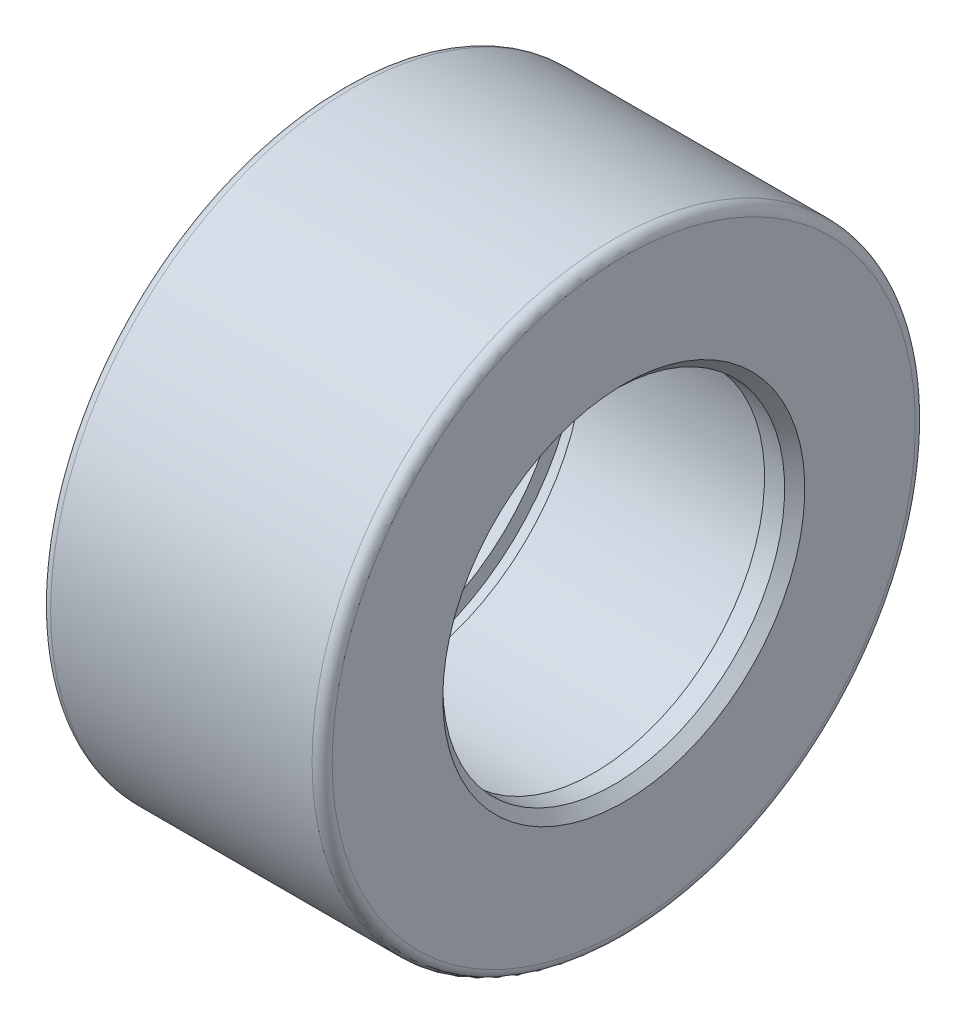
ISO-10303-21;
HEADER;
FILE_DESCRIPTION(('STEP AP214'),'2;1');
FILE_NAME('part.step','',(''),(''),'','','');
FILE_SCHEMA(('AUTOMOTIVE_DESIGN { 1 0 10303 214 1 1 1 1 }'));
ENDSEC;
DATA;
#1=APPLICATION_CONTEXT('core data for automotive mechanical design processes');
#2=APPLICATION_PROTOCOL_DEFINITION('international standard','automotive_design',2000,#1);
#3=PRODUCT_CONTEXT('',#1,'mechanical');
#4=PRODUCT('Part','Part','',(#3));
#5=PRODUCT_RELATED_PRODUCT_CATEGORY('part','',(#4));
#6=PRODUCT_DEFINITION_FORMATION('','',#4);
#7=PRODUCT_DEFINITION_CONTEXT('part definition',#1,'design');
#8=PRODUCT_DEFINITION('design','',#6,#7);
#9=PRODUCT_DEFINITION_SHAPE('','',#8);
#10=(LENGTH_UNIT() NAMED_UNIT(*) SI_UNIT(.MILLI.,.METRE.));
#11=(NAMED_UNIT(*) PLANE_ANGLE_UNIT() SI_UNIT($,.RADIAN.));
#12=(NAMED_UNIT(*) SI_UNIT($,.STERADIAN.) SOLID_ANGLE_UNIT());
#13=UNCERTAINTY_MEASURE_WITH_UNIT(LENGTH_MEASURE(1.E-05),#10,'distance_accuracy_value','');
#14=(GEOMETRIC_REPRESENTATION_CONTEXT(3) GLOBAL_UNCERTAINTY_ASSIGNED_CONTEXT((#13)) GLOBAL_UNIT_ASSIGNED_CONTEXT((#10,
#11,#12)) REPRESENTATION_CONTEXT('',''));
#15=CARTESIAN_POINT('',(0.,0.,0.));
#16=DIRECTION('',(0.,0.,1.));
#17=DIRECTION('',(1.,0.,0.));
#18=AXIS2_PLACEMENT_3D('',#15,#16,#17);
#19=CARTESIAN_POINT('',(-12.5,9.5,0.));
#20=DIRECTION('',(-1.,0.,0.));
#21=DIRECTION('',(0.,0.,1.));
#22=AXIS2_PLACEMENT_3D('',#19,#20,#21);
#23=PLANE('',#22);
#24=CARTESIAN_POINT('',(-12.5,0.,0.));
#25=DIRECTION('',(-1.,0.,0.));
#26=DIRECTION('',(0.,0.,1.));
#27=AXIS2_PLACEMENT_3D('',#24,#25,#26);
#28=CIRCLE('',#27,10.25);
#29=CARTESIAN_POINT('',(-12.5,0.,10.25));
#30=VERTEX_POINT('',#29);
#31=EDGE_CURVE('E80',#30,#30,#28,.T.);
#32=ORIENTED_EDGE('',*,*,#31,.F.);
#33=EDGE_LOOP('',(#32));
#34=FACE_BOUND('',#33,.T.);
#35=CARTESIAN_POINT('',(-12.5,0.,0.));
#36=DIRECTION('',(-1.,0.,0.));
#37=DIRECTION('',(0.,0.,1.));
#38=AXIS2_PLACEMENT_3D('',#35,#36,#37);
#39=CIRCLE('',#38,9.5);
#40=CARTESIAN_POINT('',(-12.5,0.,9.5));
#41=VERTEX_POINT('',#40);
#42=EDGE_CURVE('E65',#41,#41,#39,.T.);
#43=ORIENTED_EDGE('',*,*,#42,.T.);
#44=EDGE_LOOP('',(#43));
#45=FACE_BOUND('',#44,.T.);
#46=ADVANCED_FACE('F33',(#34,#45),#23,.F.);
#47=CARTESIAN_POINT('',(-21.0142734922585,0.,0.));
#48=DIRECTION('',(-1.,0.,0.));
#49=DIRECTION('',(0.,0.,1.));
#50=AXIS2_PLACEMENT_3D('',#47,#48,#49);
#51=CYLINDRICAL_SURFACE('',#50,9.5);
#52=CARTESIAN_POINT('',(-13.5,0.,0.));
#53=DIRECTION('',(1.,0.,0.));
#54=DIRECTION('',(0.,0.,-1.));
#55=AXIS2_PLACEMENT_3D('',#52,#53,#54);
#56=CIRCLE('',#55,9.5);
#57=CARTESIAN_POINT('',(-13.5,0.,-9.5));
#58=VERTEX_POINT('',#57);
#59=EDGE_CURVE('E48',#58,#58,#56,.F.);
#60=ORIENTED_EDGE('',*,*,#59,.T.);
#61=EDGE_LOOP('',(#60));
#62=FACE_BOUND('',#61,.T.);
#63=ORIENTED_EDGE('',*,*,#42,.F.);
#64=EDGE_LOOP('',(#63));
#65=FACE_BOUND('',#64,.T.);
#66=ADVANCED_FACE('F88',(#62,#65),#51,.F.);
#67=CARTESIAN_POINT('',(-14.,15.,0.));
#68=DIRECTION('',(1.,0.,0.));
#69=DIRECTION('',(0.,0.,-1.));
#70=AXIS2_PLACEMENT_3D('',#67,#68,#69);
#71=PLANE('',#70);
#72=CARTESIAN_POINT('',(-14.,0.,0.));
#73=DIRECTION('',(1.,0.,0.));
#74=DIRECTION('',(0.,0.,-1.));
#75=AXIS2_PLACEMENT_3D('',#72,#73,#74);
#76=CIRCLE('',#75,9.99999999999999);
#77=CARTESIAN_POINT('',(-14.,0.,-9.99999999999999));
#78=VERTEX_POINT('',#77);
#79=EDGE_CURVE('E44',#78,#78,#76,.T.);
#80=ORIENTED_EDGE('',*,*,#79,.T.);
#81=EDGE_LOOP('',(#80));
#82=FACE_BOUND('',#81,.T.);
#83=CARTESIAN_POINT('',(-14.,0.,0.));
#84=DIRECTION('',(1.,0.,0.));
#85=DIRECTION('',(0.,0.,-1.));
#86=AXIS2_PLACEMENT_3D('',#83,#84,#85);
#87=CIRCLE('',#86,14.5);
#88=CARTESIAN_POINT('',(-14.,0.,-14.5));
#89=VERTEX_POINT('',#88);
#90=EDGE_CURVE('E62',#89,#89,#87,.F.);
#91=ORIENTED_EDGE('',*,*,#90,.T.);
#92=EDGE_LOOP('',(#91));
#93=FACE_BOUND('',#92,.T.);
#94=ADVANCED_FACE('F93',(#82,#93),#71,.F.);
#95=CARTESIAN_POINT('',(-21.0142734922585,0.,0.));
#96=DIRECTION('',(-1.,0.,0.));
#97=DIRECTION('',(0.,0.,1.));
#98=AXIS2_PLACEMENT_3D('',#95,#96,#97);
#99=CYLINDRICAL_SURFACE('',#98,15.);
#100=CARTESIAN_POINT('',(-13.5,0.,0.));
#101=DIRECTION('',(1.,0.,0.));
#102=DIRECTION('',(0.,0.,-1.));
#103=AXIS2_PLACEMENT_3D('',#100,#101,#102);
#104=CIRCLE('',#103,15.);
#105=CARTESIAN_POINT('',(-13.5,0.,-15.));
#106=VERTEX_POINT('',#105);
#107=EDGE_CURVE('E56',#106,#106,#104,.T.);
#108=ORIENTED_EDGE('',*,*,#107,.T.);
#109=EDGE_LOOP('',(#108));
#110=FACE_BOUND('',#109,.T.);
#111=CARTESIAN_POINT('',(-0.5,0.,0.));
#112=DIRECTION('',(-1.,0.,0.));
#113=DIRECTION('',(0.,0.,1.));
#114=AXIS2_PLACEMENT_3D('',#111,#112,#113);
#115=CIRCLE('',#114,15.);
#116=CARTESIAN_POINT('',(-0.5,0.,15.));
#117=VERTEX_POINT('',#116);
#118=EDGE_CURVE('E59',#117,#117,#115,.T.);
#119=ORIENTED_EDGE('',*,*,#118,.T.);
#120=EDGE_LOOP('',(#119));
#121=FACE_BOUND('',#120,.T.);
#122=ADVANCED_FACE('F99',(#110,#121),#99,.T.);
#123=CARTESIAN_POINT('',(0.,8.5,0.));
#124=DIRECTION('',(-1.,0.,0.));
#125=DIRECTION('',(0.,0.,1.));
#126=AXIS2_PLACEMENT_3D('',#123,#124,#125);
#127=PLANE('',#126);
#128=CARTESIAN_POINT('',(0.,0.,0.));
#129=DIRECTION('',(-1.,0.,0.));
#130=DIRECTION('',(0.,0.,1.));
#131=AXIS2_PLACEMENT_3D('',#128,#129,#130);
#132=CIRCLE('',#131,8.99999999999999);
#133=CARTESIAN_POINT('',(0.,0.,8.99999999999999));
#134=VERTEX_POINT('',#133);
#135=EDGE_CURVE('E40',#134,#134,#132,.T.);
#136=ORIENTED_EDGE('',*,*,#135,.T.);
#137=EDGE_LOOP('',(#136));
#138=FACE_BOUND('',#137,.T.);
#139=CARTESIAN_POINT('',(0.,0.,0.));
#140=DIRECTION('',(-1.,0.,0.));
#141=DIRECTION('',(0.,0.,1.));
#142=AXIS2_PLACEMENT_3D('',#139,#140,#141);
#143=CIRCLE('',#142,14.5);
#144=CARTESIAN_POINT('',(0.,0.,14.5));
#145=VERTEX_POINT('',#144);
#146=EDGE_CURVE('E53',#145,#145,#143,.F.);
#147=ORIENTED_EDGE('',*,*,#146,.T.);
#148=EDGE_LOOP('',(#147));
#149=FACE_BOUND('',#148,.T.);
#150=ADVANCED_FACE('F143',(#138,#149),#127,.F.);
#151=CARTESIAN_POINT('',(-21.0142734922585,0.,0.));
#152=DIRECTION('',(-1.,0.,0.));
#153=DIRECTION('',(0.,0.,1.));
#154=AXIS2_PLACEMENT_3D('',#151,#152,#153);
#155=CYLINDRICAL_SURFACE('',#154,8.5);
#156=CARTESIAN_POINT('',(-0.499999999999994,0.,0.));
#157=DIRECTION('',(-1.,0.,0.));
#158=DIRECTION('',(0.,0.,1.));
#159=AXIS2_PLACEMENT_3D('',#156,#157,#158);
#160=CIRCLE('',#159,8.5);
#161=CARTESIAN_POINT('',(-0.499999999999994,0.,8.5));
#162=VERTEX_POINT('',#161);
#163=EDGE_CURVE('E10',#162,#162,#160,.F.);
#164=ORIENTED_EDGE('',*,*,#163,.T.);
#165=EDGE_LOOP('',(#164));
#166=FACE_BOUND('',#165,.T.);
#167=CARTESIAN_POINT('',(-1.5,0.,0.));
#168=DIRECTION('',(-1.,0.,0.));
#169=DIRECTION('',(0.,0.,1.));
#170=AXIS2_PLACEMENT_3D('',#167,#168,#169);
#171=CIRCLE('',#170,8.5);
#172=CARTESIAN_POINT('',(-1.5,0.,8.5));
#173=VERTEX_POINT('',#172);
#174=EDGE_CURVE('E68',#173,#173,#171,.T.);
#175=ORIENTED_EDGE('',*,*,#174,.T.);
#176=EDGE_LOOP('',(#175));
#177=FACE_BOUND('',#176,.T.);
#178=ADVANCED_FACE('F137',(#166,#177),#155,.F.);
#179=CARTESIAN_POINT('',(-1.5,9.5,0.));
#180=DIRECTION('',(1.,0.,0.));
#181=DIRECTION('',(0.,0.,-1.));
#182=AXIS2_PLACEMENT_3D('',#179,#180,#181);
#183=PLANE('',#182);
#184=ORIENTED_EDGE('',*,*,#174,.F.);
#185=EDGE_LOOP('',(#184));
#186=FACE_BOUND('',#185,.T.);
#187=CARTESIAN_POINT('',(-1.5,0.,0.));
#188=DIRECTION('',(-1.,0.,0.));
#189=DIRECTION('',(0.,0.,1.));
#190=AXIS2_PLACEMENT_3D('',#187,#188,#189);
#191=CIRCLE('',#190,9.5);
#192=CARTESIAN_POINT('',(-1.5,0.,9.5));
#193=VERTEX_POINT('',#192);
#194=EDGE_CURVE('E71',#193,#193,#191,.T.);
#195=ORIENTED_EDGE('',*,*,#194,.T.);
#196=EDGE_LOOP('',(#195));
#197=FACE_BOUND('',#196,.T.);
#198=ADVANCED_FACE('F142',(#186,#197),#183,.F.);
#199=CARTESIAN_POINT('',(-21.0142734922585,0.,0.));
#200=DIRECTION('',(-1.,0.,0.));
#201=DIRECTION('',(0.,0.,1.));
#202=AXIS2_PLACEMENT_3D('',#199,#200,#201);
#203=CYLINDRICAL_SURFACE('',#202,9.5);
#204=ORIENTED_EDGE('',*,*,#194,.F.);
#205=EDGE_LOOP('',(#204));
#206=FACE_BOUND('',#205,.T.);
#207=CARTESIAN_POINT('',(-11.5,0.,0.));
#208=DIRECTION('',(-1.,0.,0.));
#209=DIRECTION('',(0.,0.,1.));
#210=AXIS2_PLACEMENT_3D('',#207,#208,#209);
#211=CIRCLE('',#210,9.5);
#212=CARTESIAN_POINT('',(-11.5,0.,9.5));
#213=VERTEX_POINT('',#212);
#214=EDGE_CURVE('E74',#213,#213,#211,.T.);
#215=ORIENTED_EDGE('',*,*,#214,.T.);
#216=EDGE_LOOP('',(#215));
#217=FACE_BOUND('',#216,.T.);
#218=ADVANCED_FACE('F202',(#206,#217),#203,.F.);
#219=CARTESIAN_POINT('',(-11.5,10.25,0.));
#220=DIRECTION('',(1.,0.,0.));
#221=DIRECTION('',(0.,0.,-1.));
#222=AXIS2_PLACEMENT_3D('',#219,#220,#221);
#223=PLANE('',#222);
#224=ORIENTED_EDGE('',*,*,#214,.F.);
#225=EDGE_LOOP('',(#224));
#226=FACE_BOUND('',#225,.T.);
#227=CARTESIAN_POINT('',(-11.5,0.,0.));
#228=DIRECTION('',(-1.,0.,0.));
#229=DIRECTION('',(0.,0.,1.));
#230=AXIS2_PLACEMENT_3D('',#227,#228,#229);
#231=CIRCLE('',#230,10.25);
#232=CARTESIAN_POINT('',(-11.5,0.,10.25));
#233=VERTEX_POINT('',#232);
#234=EDGE_CURVE('E77',#233,#233,#231,.T.);
#235=ORIENTED_EDGE('',*,*,#234,.T.);
#236=EDGE_LOOP('',(#235));
#237=FACE_BOUND('',#236,.T.);
#238=ADVANCED_FACE('F192',(#226,#237),#223,.F.);
#239=CARTESIAN_POINT('',(-21.0142734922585,0.,0.));
#240=DIRECTION('',(-1.,0.,0.));
#241=DIRECTION('',(0.,0.,1.));
#242=AXIS2_PLACEMENT_3D('',#239,#240,#241);
#243=CYLINDRICAL_SURFACE('',#242,10.25);
#244=ORIENTED_EDGE('',*,*,#234,.F.);
#245=EDGE_LOOP('',(#244));
#246=FACE_BOUND('',#245,.T.);
#247=ORIENTED_EDGE('',*,*,#31,.T.);
#248=EDGE_LOOP('',(#247));
#249=FACE_BOUND('',#248,.T.);
#250=ADVANCED_FACE('F84',(#246,#249),#243,.F.);
#251=CARTESIAN_POINT('',(-13.5,0.,0.));
#252=DIRECTION('',(1.,0.,0.));
#253=DIRECTION('',(0.,0.,-1.));
#254=AXIS2_PLACEMENT_3D('',#251,#252,#253);
#255=TOROIDAL_SURFACE('',#254,14.5,0.5);
#256=ORIENTED_EDGE('',*,*,#107,.F.);
#257=EDGE_LOOP('',(#256));
#258=FACE_BOUND('',#257,.T.);
#259=ORIENTED_EDGE('',*,*,#90,.F.);
#260=EDGE_LOOP('',(#259));
#261=FACE_BOUND('',#260,.T.);
#262=ADVANCED_FACE('F104',(#258,#261),#255,.T.);
#263=CARTESIAN_POINT('',(-0.5,0.,0.));
#264=DIRECTION('',(-1.,0.,0.));
#265=DIRECTION('',(0.,0.,1.));
#266=AXIS2_PLACEMENT_3D('',#263,#264,#265);
#267=TOROIDAL_SURFACE('',#266,14.5,0.5);
#268=ORIENTED_EDGE('',*,*,#146,.F.);
#269=EDGE_LOOP('',(#268));
#270=FACE_BOUND('',#269,.T.);
#271=ORIENTED_EDGE('',*,*,#118,.F.);
#272=EDGE_LOOP('',(#271));
#273=FACE_BOUND('',#272,.T.);
#274=ADVANCED_FACE('F107',(#270,#273),#267,.T.);
#275=CARTESIAN_POINT('',(-13.5,0.,0.));
#276=DIRECTION('',(-1.,0.,0.));
#277=DIRECTION('',(0.,0.,1.));
#278=AXIS2_PLACEMENT_3D('',#275,#276,#277);
#279=CONICAL_SURFACE('',#278,9.5,0.785398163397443);
#280=ORIENTED_EDGE('',*,*,#79,.F.);
#281=EDGE_LOOP('',(#280));
#282=FACE_BOUND('',#281,.T.);
#283=ORIENTED_EDGE('',*,*,#59,.F.);
#284=EDGE_LOOP('',(#283));
#285=FACE_BOUND('',#284,.T.);
#286=ADVANCED_FACE('F110',(#282,#285),#279,.F.);
#287=CARTESIAN_POINT('',(0.,0.,0.));
#288=DIRECTION('',(1.,0.,0.));
#289=DIRECTION('',(0.,0.,-1.));
#290=AXIS2_PLACEMENT_3D('',#287,#288,#289);
#291=CONICAL_SURFACE('',#290,8.99999999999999,0.785398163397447);
#292=ORIENTED_EDGE('',*,*,#163,.F.);
#293=EDGE_LOOP('',(#292));
#294=FACE_BOUND('',#293,.T.);
#295=ORIENTED_EDGE('',*,*,#135,.F.);
#296=EDGE_LOOP('',(#295));
#297=FACE_BOUND('',#296,.T.);
#298=ADVANCED_FACE('F35',(#294,#297),#291,.F.);
#299=CLOSED_SHELL('',(#46,#66,#94,#122,#150,#178,#198,#218,#238,#250,#262,#274,#286,#298));
#300=MANIFOLD_SOLID_BREP('B2',#299);
#301=ADVANCED_BREP_SHAPE_REPRESENTATION('',(#18,#300),#14);
#302=SHAPE_DEFINITION_REPRESENTATION(#9,#301);
ENDSEC;
END-ISO-10303-21;
